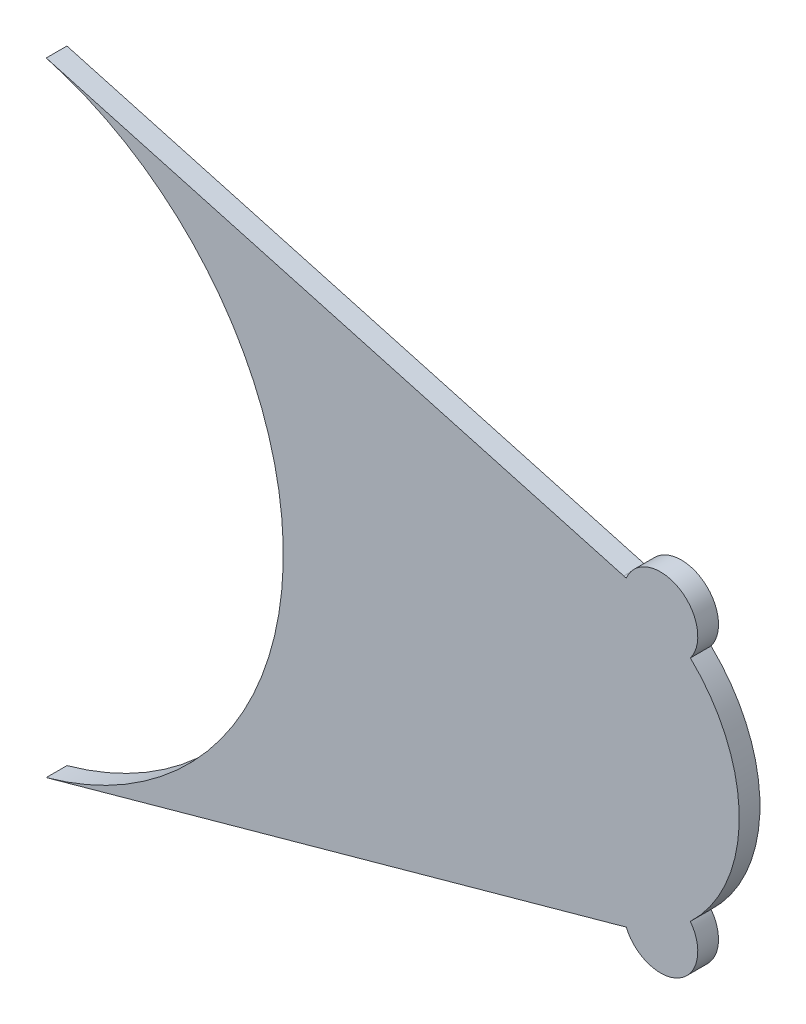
from build123d import *

# Parameters (mm, degrees)
EXTRUSION1_DEPTH = 2.5


with BuildPart() as part:
    # Esquisse1 → Extrusion1 (new body)
    with BuildSketch(Plane.XY):
        with BuildLine():
            Line((10.4, 37.587763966), (80.066666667, 18.311987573))
            ThreePointArc((80.066666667, 18.311987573), (80.215436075, 18.270173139), (80.363860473, 18.227150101))
            ThreePointArc((80.363860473, 18.227150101), (86.75, 20.351596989), (88.10324479, 13.758814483))
            ThreePointArc((88.10324479, 13.758814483), (94, 0), (88.10324479, -13.758814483))
            ThreePointArc((88.10324479, -13.758814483), (86.75, -20.351596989), (80.363860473, -18.227150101))
            ThreePointArc((80.363860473, -18.227150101), (80.215436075, -18.270173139), (80.066666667, -18.311987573))
            Line((80.066666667, -18.311987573), (10.4, -37.587763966))
            ThreePointArc((10.4, -37.587763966), (39, 0), (10.4, 37.587763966))
        make_face()
    extrude(amount=EXTRUSION1_DEPTH)


solid = part.part
